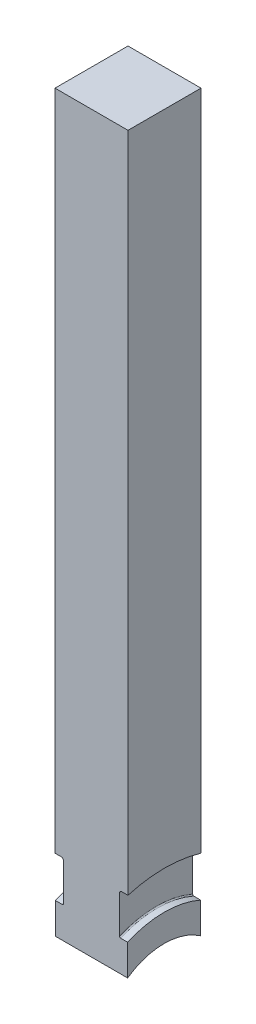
from build123d import *

# Parameters (mm, degrees)
SKETCH1_W               = 25.654
SKETCH1_H               = 276.225
BOSS_EXTRUDE1_DEPTH     = 12.827
CUT_EXTRUDE4_DEPTH      = 277.820003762
CUT_EXTRUDE4_DEPTH_BACK = 277.820003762
SKETCH8_R               = 22.225
SKETCH2_W               = 2.9718
SKETCH2_H               = 13.4874
CUT_EXTRUDE3_DEPTH      = 277.820003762
CUT_EXTRUDE3_DEPTH_BACK = 277.820003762
SKETCH7_W               = 0.127
SKETCH7_H               = 31.75
FILLET1_R               = 0.762
FILLET2_R               = 0.381


with BuildPart() as part:
    # Sketch1 → Boss-Extrude1 (new, symmetric)
    with BuildSketch(Plane(origin=(0, 0, 0), x_dir=(0, 0, -1), z_dir=(1, 0, 0))):
        with Locations((0, 138.1125)):
            Rectangle(SKETCH1_W, SKETCH1_H)
    extrude(amount=BOSS_EXTRUDE1_DEPTH, both=True)

    # Sketch8 → Cut-Extrude4 (cut, two sides: drawn at the far end of the back side and taken through both)
    with BuildSketch(Plane(origin=(0, 0, 0), x_dir=(0, 0, -1), z_dir=(1, 0, 0)).offset(-CUT_EXTRUDE4_DEPTH_BACK)):
        Circle(SKETCH8_R)
    extrude(amount=CUT_EXTRUDE4_DEPTH + CUT_EXTRUDE4_DEPTH_BACK, mode=Mode.SUBTRACT)

    # Sketch2 → Cut-Revolve1 (revolve, cut)
    with BuildSketch(Plane.XY):
        with Locations((11.3411, 38.4937)):
            Rectangle(SKETCH2_W, SKETCH2_H)
        with Locations((-11.3411, 38.4937)):
            Rectangle(SKETCH2_W, SKETCH2_H)
    revolve(axis=Axis((-8.84822894, 0, 0), (1, 0, 0)), mode=Mode.SUBTRACT)

    # Sketch7 → Cut-Extrude3 (cut, two sides: drawn at the far end of the back side and taken through both)
    with BuildSketch(Plane.XY.offset(-CUT_EXTRUDE3_DEPTH_BACK)):
        with Locations((-12.7635, 15.875)):
            Rectangle(SKETCH7_W, SKETCH7_H)
        with Locations((12.7635, 15.875)):
            Rectangle(SKETCH7_W, SKETCH7_H)
    extrude(amount=CUT_EXTRUDE3_DEPTH + CUT_EXTRUDE3_DEPTH_BACK, mode=Mode.SUBTRACT)

    # Fillet1
    fillet1_edges = [part.edges().sort_by_distance(p)[0] for p in [
        (9.8552, 45.2374, 0),
        (-9.8552, 45.2374, 0),
    ]]
    fillet(fillet1_edges, radius=FILLET1_R)

    # Fillet2
    fillet2_edges = [part.edges().sort_by_distance(p)[0] for p in [
        (9.8552, 31.75, 0),
        (-9.8552, 31.75, 0),
    ]]
    fillet(fillet2_edges, radius=FILLET2_R)


solid = part.part
